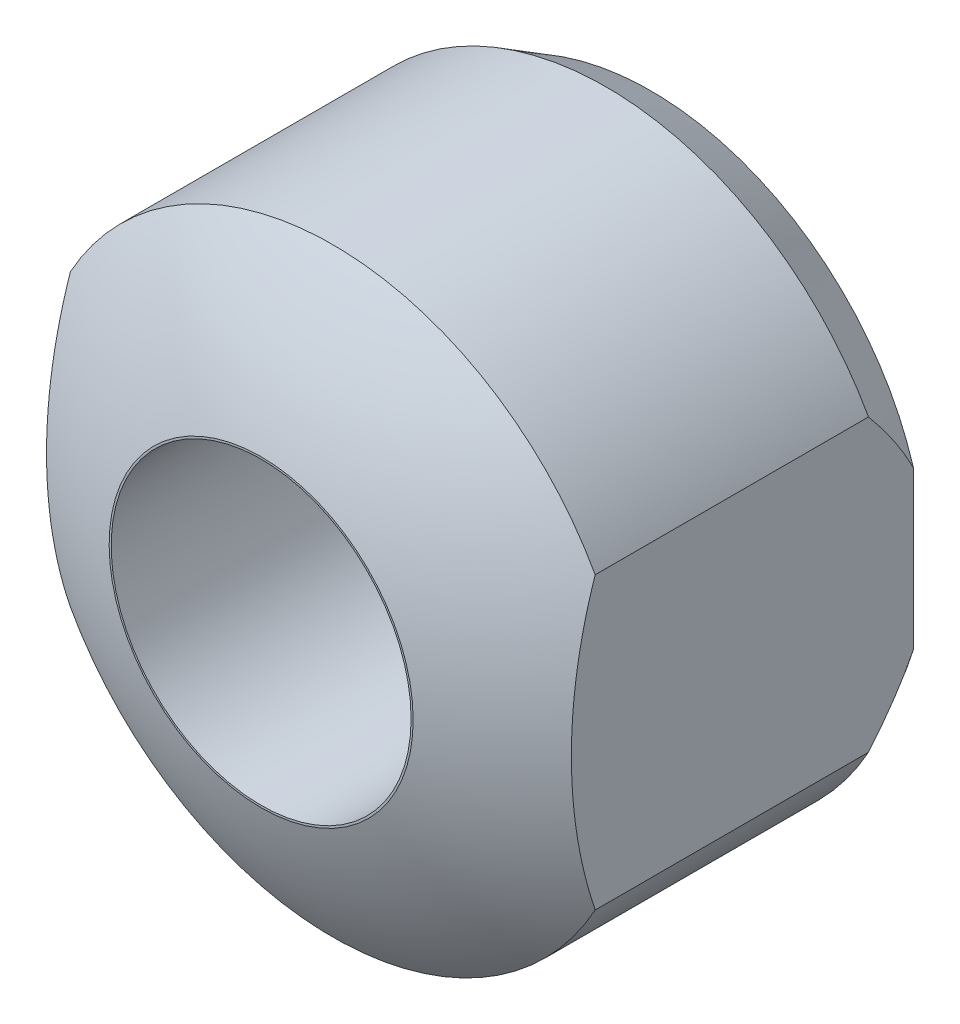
ISO-10303-21;
HEADER;
FILE_DESCRIPTION(('STEP AP214'),'2;1');
FILE_NAME('part.step','',(''),(''),'','','');
FILE_SCHEMA(('AUTOMOTIVE_DESIGN { 1 0 10303 214 1 1 1 1 }'));
ENDSEC;
DATA;
#1=APPLICATION_CONTEXT('core data for automotive mechanical design processes');
#2=APPLICATION_PROTOCOL_DEFINITION('international standard','automotive_design',2000,#1);
#3=PRODUCT_CONTEXT('',#1,'mechanical');
#4=PRODUCT('Part','Part','',(#3));
#5=PRODUCT_RELATED_PRODUCT_CATEGORY('part','',(#4));
#6=PRODUCT_DEFINITION_FORMATION('','',#4);
#7=PRODUCT_DEFINITION_CONTEXT('part definition',#1,'design');
#8=PRODUCT_DEFINITION('design','',#6,#7);
#9=PRODUCT_DEFINITION_SHAPE('','',#8);
#10=(LENGTH_UNIT() NAMED_UNIT(*) SI_UNIT(.MILLI.,.METRE.));
#11=(NAMED_UNIT(*) PLANE_ANGLE_UNIT() SI_UNIT($,.RADIAN.));
#12=(NAMED_UNIT(*) SI_UNIT($,.STERADIAN.) SOLID_ANGLE_UNIT());
#13=UNCERTAINTY_MEASURE_WITH_UNIT(LENGTH_MEASURE(1.E-05),#10,'distance_accuracy_value','');
#14=(GEOMETRIC_REPRESENTATION_CONTEXT(3) GLOBAL_UNCERTAINTY_ASSIGNED_CONTEXT((#13)) GLOBAL_UNIT_ASSIGNED_CONTEXT((#10,
#11,#12)) REPRESENTATION_CONTEXT('',''));
#15=CARTESIAN_POINT('',(0.,0.,0.));
#16=DIRECTION('',(0.,0.,1.));
#17=DIRECTION('',(1.,0.,0.));
#18=AXIS2_PLACEMENT_3D('',#15,#16,#17);
#19=CARTESIAN_POINT('',(1.71303943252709E-13,0.,-1.49999999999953));
#20=DIRECTION('',(0.,0.,1.));
#21=DIRECTION('',(1.,0.,0.));
#22=AXIS2_PLACEMENT_3D('',#19,#20,#21);
#23=SPHERICAL_SURFACE('',#22,6.9999999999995);
#24=CARTESIAN_POINT('',(0.,0.,5.2));
#25=DIRECTION('',(0.,0.,1.));
#26=DIRECTION('',(0.,-1.,0.));
#27=AXIS2_PLACEMENT_3D('',#24,#25,#26);
#28=CIRCLE('',#27,2.0273134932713);
#29=CARTESIAN_POINT('',(0.,-2.0273134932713,5.2));
#30=VERTEX_POINT('',#29);
#31=EDGE_CURVE('E9',#30,#30,#28,.T.);
#32=ORIENTED_EDGE('',*,*,#31,.F.);
#33=EDGE_LOOP('',(#32));
#34=FACE_BOUND('',#33,.T.);
#35=CARTESIAN_POINT('',(-3.5,0.,-1.49999999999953));
#36=DIRECTION('',(1.,0.,0.));
#37=DIRECTION('',(0.,1.,0.));
#38=AXIS2_PLACEMENT_3D('',#35,#36,#37);
#39=CIRCLE('',#38,6.06217782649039);
#40=CARTESIAN_POINT('',(-3.5,-1.93649167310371,4.244562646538));
#41=VERTEX_POINT('',#40);
#42=CARTESIAN_POINT('',(-3.5,1.93649167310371,4.244562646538));
#43=VERTEX_POINT('',#42);
#44=EDGE_CURVE('E104',#41,#43,#39,.F.);
#45=ORIENTED_EDGE('',*,*,#44,.F.);
#46=CARTESIAN_POINT('',(0.,0.,4.244562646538));
#47=DIRECTION('',(0.,0.,1.));
#48=DIRECTION('',(0.,-1.,0.));
#49=AXIS2_PLACEMENT_3D('',#46,#47,#48);
#50=CIRCLE('',#49,4.);
#51=CARTESIAN_POINT('',(3.5,-1.93649167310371,4.244562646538));
#52=VERTEX_POINT('',#51);
#53=EDGE_CURVE('E99',#41,#52,#50,.T.);
#54=ORIENTED_EDGE('',*,*,#53,.T.);
#55=CARTESIAN_POINT('',(3.5,0.,-1.49999999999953));
#56=DIRECTION('',(-1.,0.,0.));
#57=DIRECTION('',(0.,-1.,0.));
#58=AXIS2_PLACEMENT_3D('',#55,#56,#57);
#59=CIRCLE('',#58,6.06217782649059);
#60=CARTESIAN_POINT('',(3.5,1.93649167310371,4.244562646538));
#61=VERTEX_POINT('',#60);
#62=EDGE_CURVE('E92',#61,#52,#59,.F.);
#63=ORIENTED_EDGE('',*,*,#62,.F.);
#64=EDGE_CURVE('E22',#61,#43,#50,.T.);
#65=ORIENTED_EDGE('',*,*,#64,.T.);
#66=EDGE_LOOP('',(#45,#54,#63,#65));
#67=FACE_BOUND('',#66,.T.);
#68=ADVANCED_FACE('F14',(#34,#67),#23,.T.);
#69=CARTESIAN_POINT('',(0.,0.,0.));
#70=DIRECTION('',(0.,0.,1.));
#71=DIRECTION('',(0.,-1.,0.));
#72=AXIS2_PLACEMENT_3D('',#69,#70,#71);
#73=CYLINDRICAL_SURFACE('',#72,4.);
#74=ORIENTED_EDGE('',*,*,#53,.F.);
#75=DIRECTION('',(0.,0.,1.));
#76=VECTOR('',#75,1.);
#77=CARTESIAN_POINT('',(-3.5,-1.93649167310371,0.));
#78=LINE('',#77,#76);
#79=CARTESIAN_POINT('',(-3.5,-1.93649167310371,0.6));
#80=VERTEX_POINT('',#79);
#81=EDGE_CURVE('E77',#41,#80,#78,.F.);
#82=ORIENTED_EDGE('',*,*,#81,.T.);
#83=CARTESIAN_POINT('',(0.,0.,0.6));
#84=DIRECTION('',(0.,0.,1.));
#85=DIRECTION('',(0.,-1.,0.));
#86=AXIS2_PLACEMENT_3D('',#83,#84,#85);
#87=CIRCLE('',#86,4.);
#88=CARTESIAN_POINT('',(3.5,-1.93649167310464,0.600000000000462));
#89=VERTEX_POINT('',#88);
#90=EDGE_CURVE('E85',#80,#89,#87,.T.);
#91=ORIENTED_EDGE('',*,*,#90,.T.);
#92=DIRECTION('',(0.,0.,1.));
#93=VECTOR('',#92,1.);
#94=CARTESIAN_POINT('',(3.5,-1.93649167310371,0.));
#95=LINE('',#94,#93);
#96=EDGE_CURVE('E109',#89,#52,#95,.T.);
#97=ORIENTED_EDGE('',*,*,#96,.T.);
#98=EDGE_LOOP('',(#74,#82,#91,#97));
#99=FACE_BOUND('',#98,.T.);
#100=ADVANCED_FACE('F110',(#99),#73,.T.);
#101=CARTESIAN_POINT('',(0.,0.,0.6));
#102=DIRECTION('',(0.,0.,1.));
#103=DIRECTION('',(0.,-1.,0.));
#104=AXIS2_PLACEMENT_3D('',#101,#102,#103);
#105=CONICAL_SURFACE('',#104,4.,0.52359877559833);
#106=ORIENTED_EDGE('',*,*,#90,.F.);
#107=CARTESIAN_POINT('',(-3.5,-4.11382868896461,3.02704980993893));
#108=CARTESIAN_POINT('',(-3.5,-4.02556301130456,2.9106368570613));
#109=CARTESIAN_POINT('',(-3.5,-3.93656137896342,2.79477349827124));
#110=CARTESIAN_POINT('',(-3.5,-3.75675469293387,2.5644059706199));
#111=CARTESIAN_POINT('',(-3.5,-3.66594916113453,2.44990217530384));
#112=CARTESIAN_POINT('',(-3.5,-3.48130560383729,2.22140763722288));
#113=CARTESIAN_POINT('',(-3.5,-3.38744599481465,2.10743428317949));
#114=CARTESIAN_POINT('',(-3.5,-3.19718668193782,1.88164400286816));
#115=CARTESIAN_POINT('',(-3.5,-3.1007872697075,1.76982683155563));
#116=CARTESIAN_POINT('',(-3.5,-2.89936226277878,1.54265294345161));
#117=CARTESIAN_POINT('',(-3.5,-2.79415734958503,1.42745450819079));
#118=CARTESIAN_POINT('',(-3.5,-2.57951892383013,1.20107246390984));
#119=CARTESIAN_POINT('',(-3.5,-2.47008608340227,1.08988822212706));
#120=CARTESIAN_POINT('',(-3.5,-2.24639213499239,0.873400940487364));
#121=CARTESIAN_POINT('',(-3.5,-2.13215282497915,0.768075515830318));
#122=CARTESIAN_POINT('',(-3.5,-1.89715999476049,0.56501713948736));
#123=CARTESIAN_POINT('',(-3.5,-1.77641218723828,0.46727770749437));
#124=CARTESIAN_POINT('',(-3.5,-1.59131616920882,0.330476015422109));
#125=CARTESIAN_POINT('',(-3.5,-1.53008053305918,0.2872002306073));
#126=CARTESIAN_POINT('',(-3.5,-1.40549732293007,0.20374482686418));
#127=CARTESIAN_POINT('',(-3.5,-1.34214915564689,0.163566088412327));
#128=CARTESIAN_POINT('',(-3.5,-1.21349365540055,0.0871545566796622));
#129=CARTESIAN_POINT('',(-3.5,-1.1481968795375,0.0509041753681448));
#130=CARTESIAN_POINT('',(-3.5,-1.0153130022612,-0.0170653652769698));
#131=CARTESIAN_POINT('',(-3.5,-0.947726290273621,-0.0487852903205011));
#132=CARTESIAN_POINT('',(-3.5,-0.761562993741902,-0.127296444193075));
#133=CARTESIAN_POINT('',(-3.5,-0.640668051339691,-0.168922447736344));
#134=CARTESIAN_POINT('',(-3.5,-0.455535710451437,-0.215813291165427));
#135=CARTESIAN_POINT('',(-3.5,-0.393214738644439,-0.228850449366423));
#136=CARTESIAN_POINT('',(-3.5,-0.267665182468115,-0.249284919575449));
#137=CARTESIAN_POINT('',(-3.5,-0.204437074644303,-0.256685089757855));
#138=CARTESIAN_POINT('',(-3.5,-0.0771357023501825,-0.265560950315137));
#139=CARTESIAN_POINT('',(-3.5,-0.0130596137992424,-0.266996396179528));
#140=CARTESIAN_POINT('',(-3.5,0.114936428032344,-0.263770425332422));
#141=CARTESIAN_POINT('',(-3.5,0.178856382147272,-0.259109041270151));
#142=CARTESIAN_POINT('',(-3.5,0.306037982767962,-0.243887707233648));
#143=CARTESIAN_POINT('',(-3.5,0.369299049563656,-0.233322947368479));
#144=CARTESIAN_POINT('',(-3.5,0.494672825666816,-0.206727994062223));
#145=CARTESIAN_POINT('',(-3.5,0.556784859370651,-0.190694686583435));
#146=CARTESIAN_POINT('',(-3.5,0.776974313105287,-0.124346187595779));
#147=CARTESIAN_POINT('',(-3.5,0.930937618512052,-0.0600029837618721));
#148=CARTESIAN_POINT('',(-3.5,1.15321180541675,0.0533615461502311));
#149=CARTESIAN_POINT('',(-3.5,1.22611109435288,0.0941402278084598));
#150=CARTESIAN_POINT('',(-3.5,1.36915922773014,0.180280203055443));
#151=CARTESIAN_POINT('',(-3.5,1.4393088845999,0.225640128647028));
#152=CARTESIAN_POINT('',(-3.5,1.59181054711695,0.330163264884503));
#153=CARTESIAN_POINT('',(-3.5,1.67355625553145,0.390201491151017));
#154=CARTESIAN_POINT('',(-3.5,1.83378409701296,0.514524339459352));
#155=CARTESIAN_POINT('',(-3.5,1.91226484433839,0.578810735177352));
#156=CARTESIAN_POINT('',(-3.5,2.0648214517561,0.709374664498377));
#157=CARTESIAN_POINT('',(-3.5,2.13895411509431,0.775586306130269));
#158=CARTESIAN_POINT('',(-3.5,2.28474237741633,0.910506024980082));
#159=CARTESIAN_POINT('',(-3.5,2.35640100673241,0.979210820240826));
#160=CARTESIAN_POINT('',(-3.5,2.4270498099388,1.04890408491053));
#161=B_SPLINE_CURVE_WITH_KNOTS('',3,(#107,#108,#109,#110,#111,#112,#113,#114,#115,#116,#117,
#118,#119,#120,#121,#122,#123,#124,#125,#126,#127,#128,#129,#130,#131,#132,#133,#134,#135,#136,
#137,#138,#139,#140,#141,#142,#143,#144,#145,#146,#147,#148,#149,#150,#151,#152,#153,#154,#155,
#156,#157,#158,#159,#160),.UNSPECIFIED.,.F.,.F.,(4,2,2,2,2,2,2,2,2,2,2,2,2,2,2,2,2,2,2,2,2,2,2,
2,2,2,4),(0.,0.438282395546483,0.87668254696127,1.31959158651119,1.76244999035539,
2.23039392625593,2.69826377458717,3.16420208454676,3.62973788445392,3.85461476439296,
4.07955534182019,4.30344313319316,4.52729303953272,4.90914491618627,5.09994335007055,
5.29064497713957,5.48263121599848,5.67461642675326,5.86675828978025,6.05900975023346,
6.5563219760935,6.80683576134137,7.05727496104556,7.3613787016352,7.6656102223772,
7.96373349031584,8.26147761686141),.UNSPECIFIED.);
#162=CARTESIAN_POINT('',(-3.5,-1.04819783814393,0.));
#163=VERTEX_POINT('',#162);
#164=EDGE_CURVE('E69',#80,#163,#161,.T.);
#165=ORIENTED_EDGE('',*,*,#164,.T.);
#166=CARTESIAN_POINT('',(0.,0.,0.));
#167=DIRECTION('',(0.,0.,1.));
#168=DIRECTION('',(0.,-1.,0.));
#169=AXIS2_PLACEMENT_3D('',#166,#167,#168);
#170=CIRCLE('',#169,3.6535898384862);
#171=CARTESIAN_POINT('',(3.5,-1.04819783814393,0.));
#172=VERTEX_POINT('',#171);
#173=EDGE_CURVE('E83',#163,#172,#170,.T.);
#174=ORIENTED_EDGE('',*,*,#173,.T.);
#175=CARTESIAN_POINT('',(3.5,2.4270498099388,1.04890408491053));
#176=CARTESIAN_POINT('',(3.5,2.38065519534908,1.00311727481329));
#177=CARTESIAN_POINT('',(3.5,2.33382246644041,0.9577753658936));
#178=CARTESIAN_POINT('',(3.5,2.23917152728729,0.868111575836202));
#179=CARTESIAN_POINT('',(3.5,2.19135309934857,0.82378992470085));
#180=CARTESIAN_POINT('',(3.5,2.04583982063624,0.692177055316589));
#181=CARTESIAN_POINT('',(3.5,1.94651391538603,0.606663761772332));
#182=CARTESIAN_POINT('',(3.5,1.73972570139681,0.439669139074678));
#183=CARTESIAN_POINT('',(3.5,1.63211162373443,0.358374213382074));
#184=CARTESIAN_POINT('',(3.5,1.41045467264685,0.205341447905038));
#185=CARTESIAN_POINT('',(3.5,1.29642536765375,0.133584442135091));
#186=CARTESIAN_POINT('',(3.5,1.12074841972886,0.0364835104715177));
#187=CARTESIAN_POINT('',(3.5,1.06190330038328,0.00607360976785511));
#188=CARTESIAN_POINT('',(3.5,0.942393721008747,-0.0509131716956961));
#189=CARTESIAN_POINT('',(3.5,0.881729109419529,-0.0774897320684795));
#190=CARTESIAN_POINT('',(3.5,0.697775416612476,-0.150149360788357));
#191=CARTESIAN_POINT('',(3.5,0.571685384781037,-0.189646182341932));
#192=CARTESIAN_POINT('',(3.5,0.377877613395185,-0.231835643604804));
#193=CARTESIAN_POINT('',(3.5,0.311954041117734,-0.243075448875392));
#194=CARTESIAN_POINT('',(3.5,0.179310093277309,-0.259153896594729));
#195=CARTESIAN_POINT('',(3.5,0.112589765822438,-0.263992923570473));
#196=CARTESIAN_POINT('',(3.5,-0.0210287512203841,-0.26702074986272));
#197=CARTESIAN_POINT('',(3.5,-0.0879270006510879,-0.265206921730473));
#198=CARTESIAN_POINT('',(3.5,-0.221206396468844,-0.255026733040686));
#199=CARTESIAN_POINT('',(3.5,-0.287587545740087,-0.246660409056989));
#200=CARTESIAN_POINT('',(3.5,-0.467734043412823,-0.21529325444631));
#201=CARTESIAN_POINT('',(3.5,-0.580442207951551,-0.186054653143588));
#202=CARTESIAN_POINT('',(3.5,-0.800591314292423,-0.112287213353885));
#203=CARTESIAN_POINT('',(3.5,-0.908029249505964,-0.0677497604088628));
#204=CARTESIAN_POINT('',(3.5,-1.11594075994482,0.0323321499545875));
#205=CARTESIAN_POINT('',(3.5,-1.21648266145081,0.0877374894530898));
#206=CARTESIAN_POINT('',(3.5,-1.41243520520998,0.207057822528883));
#207=CARTESIAN_POINT('',(3.5,-1.50784060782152,0.2709812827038));
#208=CARTESIAN_POINT('',(3.5,-1.69487152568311,0.405732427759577));
#209=CARTESIAN_POINT('',(3.5,-1.78645636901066,0.476615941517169));
#210=CARTESIAN_POINT('',(3.5,-1.96558915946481,0.623195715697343));
#211=CARTESIAN_POINT('',(3.5,-2.05313881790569,0.698889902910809));
#212=CARTESIAN_POINT('',(3.5,-2.23368871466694,0.861964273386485));
#213=CARTESIAN_POINT('',(3.5,-2.32632433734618,0.949745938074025));
#214=CARTESIAN_POINT('',(3.5,-2.50820290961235,1.12877078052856));
#215=CARTESIAN_POINT('',(3.5,-2.59744517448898,1.22001464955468));
#216=CARTESIAN_POINT('',(3.5,-2.77319591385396,1.40531168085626));
#217=CARTESIAN_POINT('',(3.5,-2.85970071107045,1.49936831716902));
#218=CARTESIAN_POINT('',(3.5,-3.03031555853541,1.68963070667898));
#219=CARTESIAN_POINT('',(3.5,-3.11442548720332,1.78583656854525));
#220=CARTESIAN_POINT('',(3.5,-3.27709742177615,1.97587728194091));
#221=CARTESIAN_POINT('',(3.5,-3.35574360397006,2.06964027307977));
#222=CARTESIAN_POINT('',(3.5,-3.51143569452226,2.25848901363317));
#223=CARTESIAN_POINT('',(3.5,-3.5884815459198,2.35357480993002));
#224=CARTESIAN_POINT('',(3.5,-3.74093398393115,2.5445337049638));
#225=CARTESIAN_POINT('',(3.5,-3.81634515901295,2.64040314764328));
#226=CARTESIAN_POINT('',(3.5,-3.96595295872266,2.83306882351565));
#227=CARTESIAN_POINT('',(3.5,-4.04014971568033,2.92986495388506));
#228=CARTESIAN_POINT('',(3.5,-4.11382868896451,3.0270498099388));
#229=B_SPLINE_CURVE_WITH_KNOTS('',3,(#175,#176,#177,#178,#179,#180,#181,#182,#183,#184,#185,
#186,#187,#188,#189,#190,#191,#192,#193,#194,#195,#196,#197,#198,#199,#200,#201,#202,#203,#204,
#205,#206,#207,#208,#209,#210,#211,#212,#213,#214,#215,#216,#217,#218,#219,#220,#221,#222,#223,
#224,#225,#226,#227,#228),.UNSPECIFIED.,.F.,.F.,(4,2,2,2,2,2,2,2,2,2,2,2,2,2,2,2,2,2,2,2,2,2,2,
2,2,2,4),(0.,0.195544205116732,0.391132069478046,0.784115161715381,1.18838783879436,
1.59183545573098,1.79042357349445,1.9890282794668,2.38334875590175,2.58371472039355,
2.78406864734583,2.98450170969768,3.18493365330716,3.53277810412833,3.88081874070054,
4.22466501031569,4.56885563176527,4.91607643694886,5.26314860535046,5.64589217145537,
6.02871256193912,6.41202707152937,6.79536100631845,7.16247898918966,7.52961001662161,
7.89552368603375,8.26139721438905),.UNSPECIFIED.);
#230=EDGE_CURVE('E111',#172,#89,#229,.T.);
#231=ORIENTED_EDGE('',*,*,#230,.T.);
#232=EDGE_LOOP('',(#106,#165,#174,#231));
#233=FACE_BOUND('',#232,.T.);
#234=ADVANCED_FACE('F81',(#233),#105,.T.);
#235=CARTESIAN_POINT('',(3.6535898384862,0.,0.));
#236=DIRECTION('',(0.,0.,-1.));
#237=DIRECTION('',(0.,1.,0.));
#238=AXIS2_PLACEMENT_3D('',#235,#236,#237);
#239=PLANE('',#238);
#240=CARTESIAN_POINT('',(0.,0.,0.));
#241=DIRECTION('',(0.,0.,1.));
#242=DIRECTION('',(1.,0.,0.));
#243=AXIS2_PLACEMENT_3D('',#240,#241,#242);
#244=CIRCLE('',#243,2.);
#245=CARTESIAN_POINT('',(2.,0.,0.));
#246=VERTEX_POINT('',#245);
#247=EDGE_CURVE('E167',#246,#246,#244,.T.);
#248=ORIENTED_EDGE('',*,*,#247,.T.);
#249=EDGE_LOOP('',(#248));
#250=FACE_BOUND('',#249,.T.);
#251=ORIENTED_EDGE('',*,*,#173,.F.);
#252=DIRECTION('',(0.,-1.,0.));
#253=VECTOR('',#252,1.);
#254=CARTESIAN_POINT('',(-3.5,4.,0.));
#255=LINE('',#254,#253);
#256=CARTESIAN_POINT('',(-3.5,1.04819783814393,0.));
#257=VERTEX_POINT('',#256);
#258=EDGE_CURVE('E65',#257,#163,#255,.T.);
#259=ORIENTED_EDGE('',*,*,#258,.F.);
#260=CARTESIAN_POINT('',(3.5,1.04819783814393,0.));
#261=VERTEX_POINT('',#260);
#262=EDGE_CURVE('E91',#261,#257,#170,.T.);
#263=ORIENTED_EDGE('',*,*,#262,.F.);
#264=DIRECTION('',(0.,-1.,0.));
#265=VECTOR('',#264,1.);
#266=CARTESIAN_POINT('',(3.5,4.,0.));
#267=LINE('',#266,#265);
#268=EDGE_CURVE('E89',#261,#172,#267,.T.);
#269=ORIENTED_EDGE('',*,*,#268,.T.);
#270=EDGE_LOOP('',(#251,#259,#263,#269));
#271=FACE_BOUND('',#270,.T.);
#272=ADVANCED_FACE('F88',(#250,#271),#239,.T.);
#273=DIRECTION('',(0.,0.,1.));
#274=VECTOR('',#273,1.);
#275=CARTESIAN_POINT('',(-3.5,1.93649167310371,0.));
#276=LINE('',#275,#274);
#277=CARTESIAN_POINT('',(-3.5,1.93649167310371,0.6));
#278=VERTEX_POINT('',#277);
#279=EDGE_CURVE('E186',#43,#278,#276,.F.);
#280=ORIENTED_EDGE('',*,*,#279,.F.);
#281=ORIENTED_EDGE('',*,*,#64,.F.);
#282=DIRECTION('',(0.,0.,1.));
#283=VECTOR('',#282,1.);
#284=CARTESIAN_POINT('',(3.5,1.93649167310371,0.));
#285=LINE('',#284,#283);
#286=CARTESIAN_POINT('',(3.5,1.93649167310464,0.600000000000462));
#287=VERTEX_POINT('',#286);
#288=EDGE_CURVE('E29',#287,#61,#285,.T.);
#289=ORIENTED_EDGE('',*,*,#288,.F.);
#290=EDGE_CURVE('E97',#287,#278,#87,.T.);
#291=ORIENTED_EDGE('',*,*,#290,.T.);
#292=EDGE_LOOP('',(#280,#281,#289,#291));
#293=FACE_BOUND('',#292,.T.);
#294=ADVANCED_FACE('F136',(#293),#73,.T.);
#295=CARTESIAN_POINT('',(-3.5,4.11382868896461,3.02704980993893));
#296=CARTESIAN_POINT('',(-3.5,4.02556301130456,2.9106368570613));
#297=CARTESIAN_POINT('',(-3.5,3.93656137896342,2.79477349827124));
#298=CARTESIAN_POINT('',(-3.5,3.75675469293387,2.5644059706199));
#299=CARTESIAN_POINT('',(-3.5,3.66594916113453,2.44990217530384));
#300=CARTESIAN_POINT('',(-3.5,3.48130560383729,2.22140763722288));
#301=CARTESIAN_POINT('',(-3.5,3.38744599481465,2.10743428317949));
#302=CARTESIAN_POINT('',(-3.5,3.19718668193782,1.88164400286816));
#303=CARTESIAN_POINT('',(-3.5,3.1007872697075,1.76982683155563));
#304=CARTESIAN_POINT('',(-3.5,2.89936226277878,1.54265294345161));
#305=CARTESIAN_POINT('',(-3.5,2.79415734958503,1.42745450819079));
#306=CARTESIAN_POINT('',(-3.5,2.57951892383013,1.20107246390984));
#307=CARTESIAN_POINT('',(-3.5,2.47008608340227,1.08988822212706));
#308=CARTESIAN_POINT('',(-3.5,2.24639213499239,0.873400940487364));
#309=CARTESIAN_POINT('',(-3.5,2.13215282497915,0.768075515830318));
#310=CARTESIAN_POINT('',(-3.5,1.89715999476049,0.56501713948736));
#311=CARTESIAN_POINT('',(-3.5,1.77641218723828,0.46727770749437));
#312=CARTESIAN_POINT('',(-3.5,1.59131616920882,0.330476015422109));
#313=CARTESIAN_POINT('',(-3.5,1.53008053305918,0.2872002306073));
#314=CARTESIAN_POINT('',(-3.5,1.40549732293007,0.20374482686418));
#315=CARTESIAN_POINT('',(-3.5,1.34214915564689,0.163566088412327));
#316=CARTESIAN_POINT('',(-3.5,1.21349365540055,0.0871545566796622));
#317=CARTESIAN_POINT('',(-3.5,1.1481968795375,0.0509041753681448));
#318=CARTESIAN_POINT('',(-3.5,1.0153130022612,-0.0170653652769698));
#319=CARTESIAN_POINT('',(-3.5,0.947726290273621,-0.0487852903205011));
#320=CARTESIAN_POINT('',(-3.5,0.761562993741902,-0.127296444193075));
#321=CARTESIAN_POINT('',(-3.5,0.640668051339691,-0.168922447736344));
#322=CARTESIAN_POINT('',(-3.5,0.455535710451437,-0.215813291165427));
#323=CARTESIAN_POINT('',(-3.5,0.393214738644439,-0.228850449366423));
#324=CARTESIAN_POINT('',(-3.5,0.267665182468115,-0.249284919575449));
#325=CARTESIAN_POINT('',(-3.5,0.204437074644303,-0.256685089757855));
#326=CARTESIAN_POINT('',(-3.5,0.0771357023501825,-0.265560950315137));
#327=CARTESIAN_POINT('',(-3.5,0.0130596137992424,-0.266996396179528));
#328=CARTESIAN_POINT('',(-3.5,-0.114936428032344,-0.263770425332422));
#329=CARTESIAN_POINT('',(-3.5,-0.178856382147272,-0.259109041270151));
#330=CARTESIAN_POINT('',(-3.5,-0.306037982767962,-0.243887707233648));
#331=CARTESIAN_POINT('',(-3.5,-0.369299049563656,-0.233322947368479));
#332=CARTESIAN_POINT('',(-3.5,-0.494672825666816,-0.206727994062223));
#333=CARTESIAN_POINT('',(-3.5,-0.556784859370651,-0.190694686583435));
#334=CARTESIAN_POINT('',(-3.5,-0.776974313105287,-0.124346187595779));
#335=CARTESIAN_POINT('',(-3.5,-0.930937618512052,-0.0600029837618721));
#336=CARTESIAN_POINT('',(-3.5,-1.15321180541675,0.0533615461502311));
#337=CARTESIAN_POINT('',(-3.5,-1.22611109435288,0.0941402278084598));
#338=CARTESIAN_POINT('',(-3.5,-1.36915922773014,0.180280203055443));
#339=CARTESIAN_POINT('',(-3.5,-1.4393088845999,0.225640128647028));
#340=CARTESIAN_POINT('',(-3.5,-1.59181054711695,0.330163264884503));
#341=CARTESIAN_POINT('',(-3.5,-1.67355625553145,0.390201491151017));
#342=CARTESIAN_POINT('',(-3.5,-1.83378409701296,0.514524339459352));
#343=CARTESIAN_POINT('',(-3.5,-1.91226484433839,0.578810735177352));
#344=CARTESIAN_POINT('',(-3.5,-2.0648214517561,0.709374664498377));
#345=CARTESIAN_POINT('',(-3.5,-2.13895411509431,0.775586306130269));
#346=CARTESIAN_POINT('',(-3.5,-2.28474237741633,0.910506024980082));
#347=CARTESIAN_POINT('',(-3.5,-2.35640100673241,0.979210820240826));
#348=CARTESIAN_POINT('',(-3.5,-2.4270498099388,1.04890408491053));
#349=B_SPLINE_CURVE_WITH_KNOTS('',3,(#295,#296,#297,#298,#299,#300,#301,#302,#303,#304,#305,
#306,#307,#308,#309,#310,#311,#312,#313,#314,#315,#316,#317,#318,#319,#320,#321,#322,#323,#324,
#325,#326,#327,#328,#329,#330,#331,#332,#333,#334,#335,#336,#337,#338,#339,#340,#341,#342,#343,
#344,#345,#346,#347,#348),.UNSPECIFIED.,.F.,.F.,(4,2,2,2,2,2,2,2,2,2,2,2,2,2,2,2,2,2,2,2,2,2,2,
2,2,2,4),(0.,0.438282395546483,0.87668254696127,1.31959158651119,1.76244999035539,
2.23039392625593,2.69826377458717,3.16420208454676,3.62973788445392,3.85461476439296,
4.07955534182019,4.30344313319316,4.52729303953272,4.90914491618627,5.09994335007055,
5.29064497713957,5.48263121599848,5.67461642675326,5.86675828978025,6.05900975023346,
6.5563219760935,6.80683576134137,7.05727496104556,7.3613787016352,7.6656102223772,
7.96373349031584,8.26147761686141),.UNSPECIFIED.);
#350=EDGE_CURVE('E72',#278,#257,#349,.T.);
#351=ORIENTED_EDGE('',*,*,#350,.F.);
#352=ORIENTED_EDGE('',*,*,#290,.F.);
#353=CARTESIAN_POINT('',(3.5,-2.4270498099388,1.04890408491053));
#354=CARTESIAN_POINT('',(3.5,-2.38065519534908,1.00311727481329));
#355=CARTESIAN_POINT('',(3.5,-2.33382246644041,0.9577753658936));
#356=CARTESIAN_POINT('',(3.5,-2.23917152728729,0.868111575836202));
#357=CARTESIAN_POINT('',(3.5,-2.19135309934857,0.82378992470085));
#358=CARTESIAN_POINT('',(3.5,-2.04583982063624,0.692177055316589));
#359=CARTESIAN_POINT('',(3.5,-1.94651391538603,0.606663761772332));
#360=CARTESIAN_POINT('',(3.5,-1.73972570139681,0.439669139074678));
#361=CARTESIAN_POINT('',(3.5,-1.63211162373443,0.358374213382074));
#362=CARTESIAN_POINT('',(3.5,-1.41045467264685,0.205341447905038));
#363=CARTESIAN_POINT('',(3.5,-1.29642536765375,0.133584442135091));
#364=CARTESIAN_POINT('',(3.5,-1.12074841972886,0.0364835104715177));
#365=CARTESIAN_POINT('',(3.5,-1.06190330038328,0.00607360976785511));
#366=CARTESIAN_POINT('',(3.5,-0.942393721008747,-0.0509131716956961));
#367=CARTESIAN_POINT('',(3.5,-0.881729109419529,-0.0774897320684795));
#368=CARTESIAN_POINT('',(3.5,-0.697775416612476,-0.150149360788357));
#369=CARTESIAN_POINT('',(3.5,-0.571685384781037,-0.189646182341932));
#370=CARTESIAN_POINT('',(3.5,-0.377877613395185,-0.231835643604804));
#371=CARTESIAN_POINT('',(3.5,-0.311954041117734,-0.243075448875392));
#372=CARTESIAN_POINT('',(3.5,-0.179310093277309,-0.259153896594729));
#373=CARTESIAN_POINT('',(3.5,-0.112589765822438,-0.263992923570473));
#374=CARTESIAN_POINT('',(3.5,0.0210287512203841,-0.26702074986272));
#375=CARTESIAN_POINT('',(3.5,0.0879270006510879,-0.265206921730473));
#376=CARTESIAN_POINT('',(3.5,0.221206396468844,-0.255026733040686));
#377=CARTESIAN_POINT('',(3.5,0.287587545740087,-0.246660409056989));
#378=CARTESIAN_POINT('',(3.5,0.467734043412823,-0.21529325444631));
#379=CARTESIAN_POINT('',(3.5,0.580442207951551,-0.186054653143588));
#380=CARTESIAN_POINT('',(3.5,0.800591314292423,-0.112287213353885));
#381=CARTESIAN_POINT('',(3.5,0.908029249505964,-0.0677497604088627));
#382=CARTESIAN_POINT('',(3.5,1.11594075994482,0.0323321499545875));
#383=CARTESIAN_POINT('',(3.5,1.21648266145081,0.0877374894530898));
#384=CARTESIAN_POINT('',(3.5,1.41243520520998,0.207057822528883));
#385=CARTESIAN_POINT('',(3.5,1.50784060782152,0.270981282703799));
#386=CARTESIAN_POINT('',(3.5,1.69487152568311,0.405732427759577));
#387=CARTESIAN_POINT('',(3.5,1.78645636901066,0.476615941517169));
#388=CARTESIAN_POINT('',(3.5,1.96558915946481,0.623195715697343));
#389=CARTESIAN_POINT('',(3.5,2.05313881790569,0.698889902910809));
#390=CARTESIAN_POINT('',(3.5,2.23368871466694,0.861964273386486));
#391=CARTESIAN_POINT('',(3.5,2.32632433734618,0.949745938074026));
#392=CARTESIAN_POINT('',(3.5,2.50820290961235,1.12877078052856));
#393=CARTESIAN_POINT('',(3.5,2.59744517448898,1.22001464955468));
#394=CARTESIAN_POINT('',(3.5,2.77319591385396,1.40531168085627));
#395=CARTESIAN_POINT('',(3.5,2.85970071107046,1.49936831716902));
#396=CARTESIAN_POINT('',(3.5,3.03031555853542,1.68963070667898));
#397=CARTESIAN_POINT('',(3.5,3.11442548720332,1.78583656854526));
#398=CARTESIAN_POINT('',(3.5,3.27709742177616,1.97587728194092));
#399=CARTESIAN_POINT('',(3.5,3.35574360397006,2.06964027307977));
#400=CARTESIAN_POINT('',(3.5,3.51143569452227,2.25848901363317));
#401=CARTESIAN_POINT('',(3.5,3.58848154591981,2.35357480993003));
#402=CARTESIAN_POINT('',(3.5,3.74093398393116,2.5445337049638));
#403=CARTESIAN_POINT('',(3.5,3.81634515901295,2.64040314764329));
#404=CARTESIAN_POINT('',(3.5,3.96595295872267,2.83306882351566));
#405=CARTESIAN_POINT('',(3.5,4.04014971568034,2.92986495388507));
#406=CARTESIAN_POINT('',(3.5,4.11382868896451,3.02704980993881));
#407=B_SPLINE_CURVE_WITH_KNOTS('',3,(#353,#354,#355,#356,#357,#358,#359,#360,#361,#362,#363,
#364,#365,#366,#367,#368,#369,#370,#371,#372,#373,#374,#375,#376,#377,#378,#379,#380,#381,#382,
#383,#384,#385,#386,#387,#388,#389,#390,#391,#392,#393,#394,#395,#396,#397,#398,#399,#400,#401,
#402,#403,#404,#405,#406),.UNSPECIFIED.,.F.,.F.,(4,2,2,2,2,2,2,2,2,2,2,2,2,2,2,2,2,2,2,2,2,2,2,
2,2,2,4),(0.,0.195544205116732,0.391132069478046,0.784115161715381,1.18838783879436,
1.59183545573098,1.79042357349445,1.9890282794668,2.38334875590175,2.58371472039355,
2.78406864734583,2.98450170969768,3.18493365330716,3.53277810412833,3.88081874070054,
4.22466501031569,4.56885563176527,4.91607643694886,5.26314860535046,5.64589217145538,
6.02871256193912,6.41202707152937,6.79536100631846,7.16247898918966,7.52961001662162,
7.89552368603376,8.26139721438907),.UNSPECIFIED.);
#408=EDGE_CURVE('E34',#261,#287,#407,.T.);
#409=ORIENTED_EDGE('',*,*,#408,.F.);
#410=ORIENTED_EDGE('',*,*,#262,.T.);
#411=EDGE_LOOP('',(#351,#352,#409,#410));
#412=FACE_BOUND('',#411,.T.);
#413=ADVANCED_FACE('F144',(#412),#105,.T.);
#414=CARTESIAN_POINT('',(0.,0.,5.2));
#415=DIRECTION('',(0.,0.,1.));
#416=DIRECTION('',(0.,-1.,0.));
#417=AXIS2_PLACEMENT_3D('',#414,#415,#416);
#418=PLANE('',#417);
#419=CARTESIAN_POINT('',(0.,0.,5.2));
#420=DIRECTION('',(0.,0.,1.));
#421=DIRECTION('',(1.,0.,0.));
#422=AXIS2_PLACEMENT_3D('',#419,#420,#421);
#423=CIRCLE('',#422,2.);
#424=CARTESIAN_POINT('',(2.,0.,5.2));
#425=VERTEX_POINT('',#424);
#426=EDGE_CURVE('E86',#425,#425,#423,.T.);
#427=ORIENTED_EDGE('',*,*,#426,.F.);
#428=EDGE_LOOP('',(#427));
#429=FACE_BOUND('',#428,.T.);
#430=ORIENTED_EDGE('',*,*,#31,.T.);
#431=EDGE_LOOP('',(#430));
#432=FACE_BOUND('',#431,.T.);
#433=ADVANCED_FACE('F16',(#429,#432),#418,.T.);
#434=CARTESIAN_POINT('',(3.5,4.,5.2));
#435=DIRECTION('',(-1.,0.,0.));
#436=DIRECTION('',(0.,-1.,0.));
#437=AXIS2_PLACEMENT_3D('',#434,#435,#436);
#438=PLANE('',#437);
#439=ORIENTED_EDGE('',*,*,#62,.T.);
#440=ORIENTED_EDGE('',*,*,#96,.F.);
#441=ORIENTED_EDGE('',*,*,#230,.F.);
#442=ORIENTED_EDGE('',*,*,#268,.F.);
#443=ORIENTED_EDGE('',*,*,#408,.T.);
#444=ORIENTED_EDGE('',*,*,#288,.T.);
#445=EDGE_LOOP('',(#439,#440,#441,#442,#443,#444));
#446=FACE_BOUND('',#445,.T.);
#447=ADVANCED_FACE('F108',(#446),#438,.F.);
#448=CARTESIAN_POINT('',(-3.5,4.,0.));
#449=DIRECTION('',(1.,0.,0.));
#450=DIRECTION('',(0.,1.,0.));
#451=AXIS2_PLACEMENT_3D('',#448,#449,#450);
#452=PLANE('',#451);
#453=ORIENTED_EDGE('',*,*,#44,.T.);
#454=ORIENTED_EDGE('',*,*,#279,.T.);
#455=ORIENTED_EDGE('',*,*,#350,.T.);
#456=ORIENTED_EDGE('',*,*,#258,.T.);
#457=ORIENTED_EDGE('',*,*,#164,.F.);
#458=ORIENTED_EDGE('',*,*,#81,.F.);
#459=EDGE_LOOP('',(#453,#454,#455,#456,#457,#458));
#460=FACE_BOUND('',#459,.T.);
#461=ADVANCED_FACE('F67',(#460),#452,.F.);
#462=CARTESIAN_POINT('',(0.,0.,5.2));
#463=DIRECTION('',(0.,0.,-1.));
#464=DIRECTION('',(-1.,0.,0.));
#465=AXIS2_PLACEMENT_3D('',#462,#463,#464);
#466=CYLINDRICAL_SURFACE('',#465,2.);
#467=ORIENTED_EDGE('',*,*,#426,.T.);
#468=EDGE_LOOP('',(#467));
#469=FACE_BOUND('',#468,.T.);
#470=ORIENTED_EDGE('',*,*,#247,.F.);
#471=EDGE_LOOP('',(#470));
#472=FACE_BOUND('',#471,.T.);
#473=ADVANCED_FACE('F178',(#469,#472),#466,.F.);
#474=CLOSED_SHELL('',(#68,#100,#234,#272,#294,#413,#433,#447,#461,#473));
#475=MANIFOLD_SOLID_BREP('B1',#474);
#476=ADVANCED_BREP_SHAPE_REPRESENTATION('',(#18,#475),#14);
#477=SHAPE_DEFINITION_REPRESENTATION(#9,#476);
ENDSEC;
END-ISO-10303-21;
